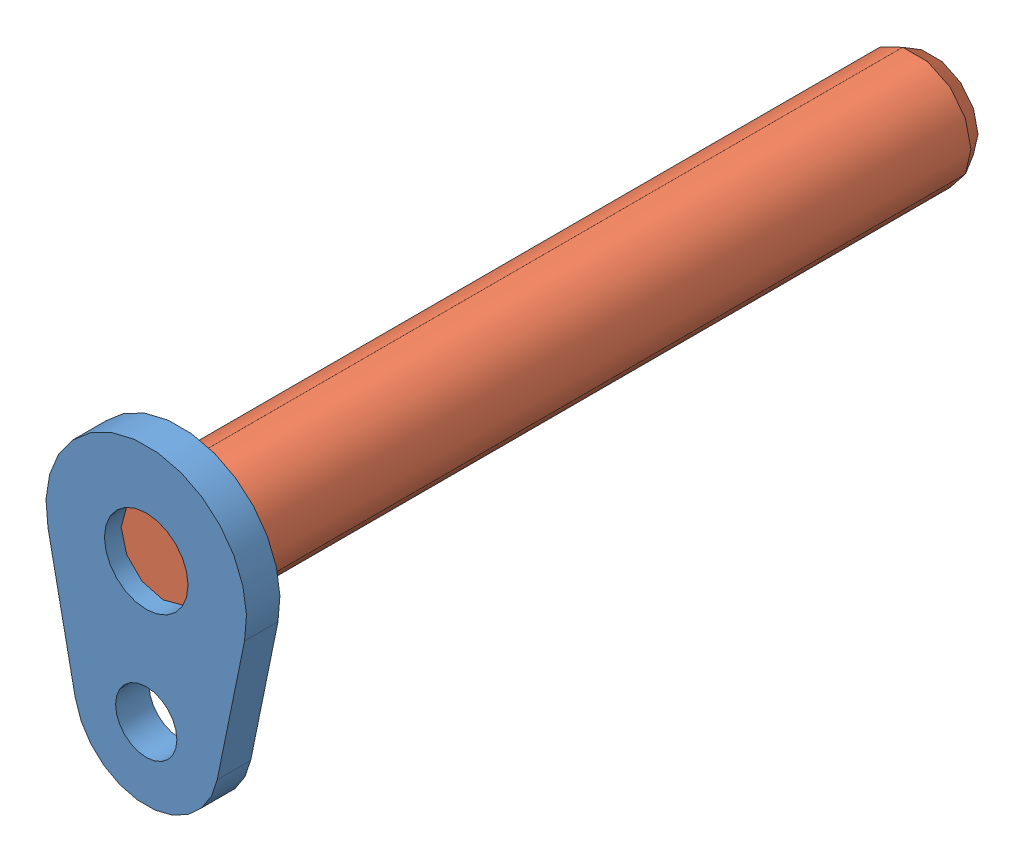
SolidWorks assembly 099 AXE VERIN.SLDASM, configuration Défaut (file format 3100). Lengths in mm.
Overall size (36 56 141).
2 component instances, 2 part files, 2 mates.
Components (placement in the parent):
- 099A-1: 099A.SLDPRT [Défaut] at origin size (36 56 6)
- 099B-1: 099B.SLDPRT [Défaut] at (0 0 3) x (0 0 -1) z (1 0 0) size (138 20 20)
Mates (geometry in assembly coordinates):
- Coaxiale1: concentric: 
- Coïncidente1: coincident anti-aligned: 
